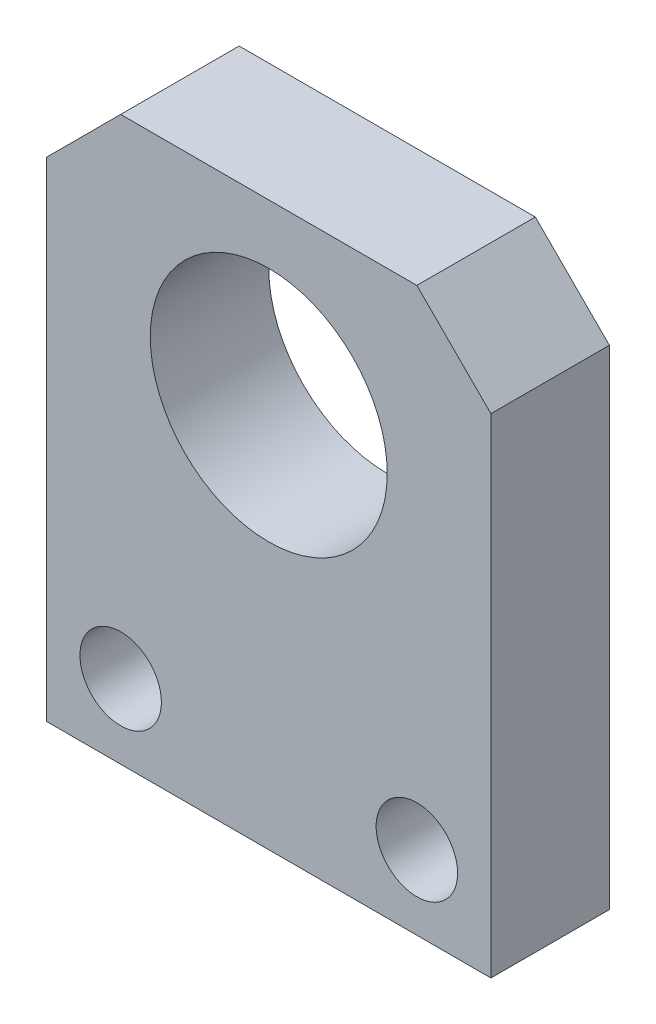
ISO-10303-21;
HEADER;
FILE_DESCRIPTION(('STEP AP214'),'2;1');
FILE_NAME('part.step','',(''),(''),'','','');
FILE_SCHEMA(('AUTOMOTIVE_DESIGN { 1 0 10303 214 1 1 1 1 }'));
ENDSEC;
DATA;
#1=APPLICATION_CONTEXT('core data for automotive mechanical design processes');
#2=APPLICATION_PROTOCOL_DEFINITION('international standard','automotive_design',2000,#1);
#3=PRODUCT_CONTEXT('',#1,'mechanical');
#4=PRODUCT('Part','Part','',(#3));
#5=PRODUCT_RELATED_PRODUCT_CATEGORY('part','',(#4));
#6=PRODUCT_DEFINITION_FORMATION('','',#4);
#7=PRODUCT_DEFINITION_CONTEXT('part definition',#1,'design');
#8=PRODUCT_DEFINITION('design','',#6,#7);
#9=PRODUCT_DEFINITION_SHAPE('','',#8);
#10=(LENGTH_UNIT() NAMED_UNIT(*) SI_UNIT(.MILLI.,.METRE.));
#11=(NAMED_UNIT(*) PLANE_ANGLE_UNIT() SI_UNIT($,.RADIAN.));
#12=(NAMED_UNIT(*) SI_UNIT($,.STERADIAN.) SOLID_ANGLE_UNIT());
#13=UNCERTAINTY_MEASURE_WITH_UNIT(LENGTH_MEASURE(1.E-05),#10,'distance_accuracy_value','');
#14=(GEOMETRIC_REPRESENTATION_CONTEXT(3) GLOBAL_UNCERTAINTY_ASSIGNED_CONTEXT((#13)) GLOBAL_UNIT_ASSIGNED_CONTEXT((#10,
#11,#12)) REPRESENTATION_CONTEXT('',''));
#15=CARTESIAN_POINT('',(0.,0.,0.));
#16=DIRECTION('',(0.,0.,1.));
#17=DIRECTION('',(1.,0.,0.));
#18=AXIS2_PLACEMENT_3D('',#15,#16,#17);
#19=CARTESIAN_POINT('',(0.,0.,0.));
#20=DIRECTION('',(0.,0.,-1.));
#21=DIRECTION('',(-1.,0.,0.));
#22=AXIS2_PLACEMENT_3D('',#19,#20,#21);
#23=PLANE('',#22);
#24=DIRECTION('',(0.,1.,0.));
#25=VECTOR('',#24,1.);
#26=CARTESIAN_POINT('',(-15.,-19.,0.));
#27=LINE('',#26,#25);
#28=CARTESIAN_POINT('',(-15.,-19.,0.));
#29=VERTEX_POINT('',#28);
#30=CARTESIAN_POINT('',(-15.,14.,0.));
#31=VERTEX_POINT('',#30);
#32=EDGE_CURVE('E67',#29,#31,#27,.T.);
#33=ORIENTED_EDGE('',*,*,#32,.T.);
#34=DIRECTION('',(0.707106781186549,0.707106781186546,0.));
#35=VECTOR('',#34,1.);
#36=CARTESIAN_POINT('',(-15.,14.,0.));
#37=LINE('',#36,#35);
#38=CARTESIAN_POINT('',(-9.99999999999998,19.,0.));
#39=VERTEX_POINT('',#38);
#40=EDGE_CURVE('E233',#31,#39,#37,.T.);
#41=ORIENTED_EDGE('',*,*,#40,.T.);
#42=DIRECTION('',(1.,0.,0.));
#43=VECTOR('',#42,1.);
#44=CARTESIAN_POINT('',(-15.,19.,0.));
#45=LINE('',#44,#43);
#46=CARTESIAN_POINT('',(10.,19.,0.));
#47=VERTEX_POINT('',#46);
#48=EDGE_CURVE('E239',#39,#47,#45,.T.);
#49=ORIENTED_EDGE('',*,*,#48,.T.);
#50=DIRECTION('',(0.707106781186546,-0.707106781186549,0.));
#51=VECTOR('',#50,1.);
#52=CARTESIAN_POINT('',(10.,19.,0.));
#53=LINE('',#52,#51);
#54=CARTESIAN_POINT('',(15.,14.,0.));
#55=VERTEX_POINT('',#54);
#56=EDGE_CURVE('E247',#47,#55,#53,.T.);
#57=ORIENTED_EDGE('',*,*,#56,.T.);
#58=DIRECTION('',(0.,1.,0.));
#59=VECTOR('',#58,1.);
#60=CARTESIAN_POINT('',(15.,-19.,0.));
#61=LINE('',#60,#59);
#62=CARTESIAN_POINT('',(15.,-19.,0.));
#63=VERTEX_POINT('',#62);
#64=EDGE_CURVE('E72',#55,#63,#61,.F.);
#65=ORIENTED_EDGE('',*,*,#64,.T.);
#66=DIRECTION('',(1.,0.,0.));
#67=VECTOR('',#66,1.);
#68=CARTESIAN_POINT('',(-15.,-19.,0.));
#69=LINE('',#68,#67);
#70=EDGE_CURVE('E70',#63,#29,#69,.F.);
#71=ORIENTED_EDGE('',*,*,#70,.T.);
#72=EDGE_LOOP('',(#33,#41,#49,#57,#65,#71));
#73=FACE_BOUND('',#72,.T.);
#74=CARTESIAN_POINT('',(0.,7.,0.));
#75=DIRECTION('',(0.,0.,1.));
#76=DIRECTION('',(1.,0.,0.));
#77=AXIS2_PLACEMENT_3D('',#74,#75,#76);
#78=CIRCLE('',#77,8.);
#79=CARTESIAN_POINT('',(8.,7.,0.));
#80=VERTEX_POINT('',#79);
#81=EDGE_CURVE('E78',#80,#80,#78,.T.);
#82=ORIENTED_EDGE('',*,*,#81,.T.);
#83=EDGE_LOOP('',(#82));
#84=FACE_BOUND('',#83,.T.);
#85=CARTESIAN_POINT('',(-10.,-14.,0.));
#86=DIRECTION('',(0.,0.,1.));
#87=DIRECTION('',(1.,0.,0.));
#88=AXIS2_PLACEMENT_3D('',#85,#86,#87);
#89=CIRCLE('',#88,2.75);
#90=CARTESIAN_POINT('',(-7.25,-14.,0.));
#91=VERTEX_POINT('',#90);
#92=EDGE_CURVE('E103',#91,#91,#89,.T.);
#93=ORIENTED_EDGE('',*,*,#92,.T.);
#94=EDGE_LOOP('',(#93));
#95=FACE_BOUND('',#94,.T.);
#96=CARTESIAN_POINT('',(10.,-14.,0.));
#97=DIRECTION('',(0.,0.,1.));
#98=DIRECTION('',(1.,0.,0.));
#99=AXIS2_PLACEMENT_3D('',#96,#97,#98);
#100=CIRCLE('',#99,2.75);
#101=CARTESIAN_POINT('',(12.75,-14.,0.));
#102=VERTEX_POINT('',#101);
#103=EDGE_CURVE('E20',#102,#102,#100,.T.);
#104=ORIENTED_EDGE('',*,*,#103,.T.);
#105=EDGE_LOOP('',(#104));
#106=FACE_BOUND('',#105,.T.);
#107=ADVANCED_FACE('F17',(#73,#84,#95,#106),#23,.T.);
#108=CARTESIAN_POINT('',(10.,-14.,0.));
#109=DIRECTION('',(0.,0.,1.));
#110=DIRECTION('',(1.,0.,0.));
#111=AXIS2_PLACEMENT_3D('',#108,#109,#110);
#112=CYLINDRICAL_SURFACE('',#111,2.75);
#113=ORIENTED_EDGE('',*,*,#103,.F.);
#114=EDGE_LOOP('',(#113));
#115=FACE_BOUND('',#114,.T.);
#116=CARTESIAN_POINT('',(10.,-14.,8.));
#117=DIRECTION('',(0.,0.,1.));
#118=DIRECTION('',(1.,0.,0.));
#119=AXIS2_PLACEMENT_3D('',#116,#117,#118);
#120=CIRCLE('',#119,2.75);
#121=CARTESIAN_POINT('',(12.75,-14.,8.));
#122=VERTEX_POINT('',#121);
#123=EDGE_CURVE('E99',#122,#122,#120,.T.);
#124=ORIENTED_EDGE('',*,*,#123,.T.);
#125=EDGE_LOOP('',(#124));
#126=FACE_BOUND('',#125,.T.);
#127=ADVANCED_FACE('F111',(#115,#126),#112,.F.);
#128=CARTESIAN_POINT('',(-10.,-14.,0.));
#129=DIRECTION('',(0.,0.,1.));
#130=DIRECTION('',(1.,0.,0.));
#131=AXIS2_PLACEMENT_3D('',#128,#129,#130);
#132=CYLINDRICAL_SURFACE('',#131,2.75);
#133=ORIENTED_EDGE('',*,*,#92,.F.);
#134=EDGE_LOOP('',(#133));
#135=FACE_BOUND('',#134,.T.);
#136=CARTESIAN_POINT('',(-10.,-14.,8.));
#137=DIRECTION('',(0.,0.,1.));
#138=DIRECTION('',(1.,0.,0.));
#139=AXIS2_PLACEMENT_3D('',#136,#137,#138);
#140=CIRCLE('',#139,2.75);
#141=CARTESIAN_POINT('',(-7.25,-14.,8.));
#142=VERTEX_POINT('',#141);
#143=EDGE_CURVE('E96',#142,#142,#140,.T.);
#144=ORIENTED_EDGE('',*,*,#143,.T.);
#145=EDGE_LOOP('',(#144));
#146=FACE_BOUND('',#145,.T.);
#147=ADVANCED_FACE('F114',(#135,#146),#132,.F.);
#148=CARTESIAN_POINT('',(0.,7.,0.));
#149=DIRECTION('',(0.,0.,1.));
#150=DIRECTION('',(1.,0.,0.));
#151=AXIS2_PLACEMENT_3D('',#148,#149,#150);
#152=CYLINDRICAL_SURFACE('',#151,8.);
#153=ORIENTED_EDGE('',*,*,#81,.F.);
#154=EDGE_LOOP('',(#153));
#155=FACE_BOUND('',#154,.T.);
#156=CARTESIAN_POINT('',(0.,7.,8.));
#157=DIRECTION('',(0.,0.,1.));
#158=DIRECTION('',(1.,0.,0.));
#159=AXIS2_PLACEMENT_3D('',#156,#157,#158);
#160=CIRCLE('',#159,8.);
#161=CARTESIAN_POINT('',(8.,7.,8.));
#162=VERTEX_POINT('',#161);
#163=EDGE_CURVE('E93',#162,#162,#160,.T.);
#164=ORIENTED_EDGE('',*,*,#163,.T.);
#165=EDGE_LOOP('',(#164));
#166=FACE_BOUND('',#165,.T.);
#167=ADVANCED_FACE('F146',(#155,#166),#152,.F.);
#168=CARTESIAN_POINT('',(-15.,-19.,8.));
#169=DIRECTION('',(0.,1.,0.));
#170=DIRECTION('',(0.,0.,1.));
#171=AXIS2_PLACEMENT_3D('',#168,#169,#170);
#172=PLANE('',#171);
#173=DIRECTION('',(0.,0.,1.));
#174=VECTOR('',#173,1.);
#175=CARTESIAN_POINT('',(15.,-19.,8.));
#176=LINE('',#175,#174);
#177=CARTESIAN_POINT('',(15.,-19.,8.));
#178=VERTEX_POINT('',#177);
#179=EDGE_CURVE('E249',#63,#178,#176,.T.);
#180=ORIENTED_EDGE('',*,*,#179,.T.);
#181=DIRECTION('',(-1.,0.,0.));
#182=VECTOR('',#181,1.);
#183=CARTESIAN_POINT('',(0.,-19.,8.));
#184=LINE('',#183,#182);
#185=CARTESIAN_POINT('',(-15.,-19.,8.));
#186=VERTEX_POINT('',#185);
#187=EDGE_CURVE('E89',#178,#186,#184,.T.);
#188=ORIENTED_EDGE('',*,*,#187,.T.);
#189=DIRECTION('',(0.,0.,-1.));
#190=VECTOR('',#189,1.);
#191=CARTESIAN_POINT('',(-15.,-19.,8.));
#192=LINE('',#191,#190);
#193=EDGE_CURVE('E77',#186,#29,#192,.T.);
#194=ORIENTED_EDGE('',*,*,#193,.T.);
#195=ORIENTED_EDGE('',*,*,#70,.F.);
#196=EDGE_LOOP('',(#180,#188,#194,#195));
#197=FACE_BOUND('',#196,.T.);
#198=ADVANCED_FACE('F88',(#197),#172,.F.);
#199=CARTESIAN_POINT('',(-15.,-19.,8.));
#200=DIRECTION('',(1.,0.,0.));
#201=DIRECTION('',(0.,0.,-1.));
#202=AXIS2_PLACEMENT_3D('',#199,#200,#201);
#203=PLANE('',#202);
#204=DIRECTION('',(0.,0.,1.));
#205=VECTOR('',#204,1.);
#206=CARTESIAN_POINT('',(-15.,14.,8.));
#207=LINE('',#206,#205);
#208=CARTESIAN_POINT('',(-15.,14.,8.));
#209=VERTEX_POINT('',#208);
#210=EDGE_CURVE('E85',#209,#31,#207,.F.);
#211=ORIENTED_EDGE('',*,*,#210,.T.);
#212=ORIENTED_EDGE('',*,*,#32,.F.);
#213=ORIENTED_EDGE('',*,*,#193,.F.);
#214=DIRECTION('',(0.,1.,0.));
#215=VECTOR('',#214,1.);
#216=CARTESIAN_POINT('',(-15.,0.,8.));
#217=LINE('',#216,#215);
#218=EDGE_CURVE('E254',#186,#209,#217,.T.);
#219=ORIENTED_EDGE('',*,*,#218,.T.);
#220=EDGE_LOOP('',(#211,#212,#213,#219));
#221=FACE_BOUND('',#220,.T.);
#222=ADVANCED_FACE('F82',(#221),#203,.F.);
#223=CARTESIAN_POINT('',(-15.,14.,8.));
#224=DIRECTION('',(0.707106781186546,-0.707106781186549,0.));
#225=DIRECTION('',(0.707106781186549,0.707106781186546,0.));
#226=AXIS2_PLACEMENT_3D('',#223,#224,#225);
#227=PLANE('',#226);
#228=DIRECTION('',(0.,0.,-1.));
#229=VECTOR('',#228,1.);
#230=CARTESIAN_POINT('',(-9.99999999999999,19.,8.));
#231=LINE('',#230,#229);
#232=CARTESIAN_POINT('',(-9.99999999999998,19.,8.));
#233=VERTEX_POINT('',#232);
#234=EDGE_CURVE('E232',#233,#39,#231,.T.);
#235=ORIENTED_EDGE('',*,*,#234,.T.);
#236=ORIENTED_EDGE('',*,*,#40,.F.);
#237=ORIENTED_EDGE('',*,*,#210,.F.);
#238=DIRECTION('',(0.707106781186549,0.707106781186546,0.));
#239=VECTOR('',#238,1.);
#240=CARTESIAN_POINT('',(-15.,14.,8.));
#241=LINE('',#240,#239);
#242=EDGE_CURVE('E235',#209,#233,#241,.T.);
#243=ORIENTED_EDGE('',*,*,#242,.T.);
#244=EDGE_LOOP('',(#235,#236,#237,#243));
#245=FACE_BOUND('',#244,.T.);
#246=ADVANCED_FACE('F137',(#245),#227,.F.);
#247=CARTESIAN_POINT('',(-15.,19.,8.));
#248=DIRECTION('',(0.,-1.,0.));
#249=DIRECTION('',(0.,0.,-1.));
#250=AXIS2_PLACEMENT_3D('',#247,#248,#249);
#251=PLANE('',#250);
#252=DIRECTION('',(0.,0.,1.));
#253=VECTOR('',#252,1.);
#254=CARTESIAN_POINT('',(10.,19.,8.));
#255=LINE('',#254,#253);
#256=CARTESIAN_POINT('',(10.,19.,8.));
#257=VERTEX_POINT('',#256);
#258=EDGE_CURVE('E241',#257,#47,#255,.F.);
#259=ORIENTED_EDGE('',*,*,#258,.T.);
#260=ORIENTED_EDGE('',*,*,#48,.F.);
#261=ORIENTED_EDGE('',*,*,#234,.F.);
#262=DIRECTION('',(-1.,0.,0.));
#263=VECTOR('',#262,1.);
#264=CARTESIAN_POINT('',(0.,19.,8.));
#265=LINE('',#264,#263);
#266=EDGE_CURVE('E257',#233,#257,#265,.F.);
#267=ORIENTED_EDGE('',*,*,#266,.T.);
#268=EDGE_LOOP('',(#259,#260,#261,#267));
#269=FACE_BOUND('',#268,.T.);
#270=ADVANCED_FACE('F133',(#269),#251,.F.);
#271=CARTESIAN_POINT('',(10.,19.,8.));
#272=DIRECTION('',(-0.707106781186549,-0.707106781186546,0.));
#273=DIRECTION('',(0.707106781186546,-0.707106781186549,0.));
#274=AXIS2_PLACEMENT_3D('',#271,#272,#273);
#275=PLANE('',#274);
#276=DIRECTION('',(0.,0.,1.));
#277=VECTOR('',#276,1.);
#278=CARTESIAN_POINT('',(15.,14.,8.));
#279=LINE('',#278,#277);
#280=CARTESIAN_POINT('',(15.,14.,8.));
#281=VERTEX_POINT('',#280);
#282=EDGE_CURVE('E34',#281,#55,#279,.F.);
#283=ORIENTED_EDGE('',*,*,#282,.T.);
#284=ORIENTED_EDGE('',*,*,#56,.F.);
#285=ORIENTED_EDGE('',*,*,#258,.F.);
#286=DIRECTION('',(0.707106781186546,-0.707106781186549,0.));
#287=VECTOR('',#286,1.);
#288=CARTESIAN_POINT('',(10.,19.,8.));
#289=LINE('',#288,#287);
#290=EDGE_CURVE('E26',#257,#281,#289,.T.);
#291=ORIENTED_EDGE('',*,*,#290,.T.);
#292=EDGE_LOOP('',(#283,#284,#285,#291));
#293=FACE_BOUND('',#292,.T.);
#294=ADVANCED_FACE('F126',(#293),#275,.F.);
#295=CARTESIAN_POINT('',(15.,-19.,8.));
#296=DIRECTION('',(-1.,0.,0.));
#297=DIRECTION('',(0.,0.,1.));
#298=AXIS2_PLACEMENT_3D('',#295,#296,#297);
#299=PLANE('',#298);
#300=ORIENTED_EDGE('',*,*,#282,.F.);
#301=DIRECTION('',(0.,1.,0.));
#302=VECTOR('',#301,1.);
#303=CARTESIAN_POINT('',(15.,0.,8.));
#304=LINE('',#303,#302);
#305=EDGE_CURVE('E11',#281,#178,#304,.F.);
#306=ORIENTED_EDGE('',*,*,#305,.T.);
#307=ORIENTED_EDGE('',*,*,#179,.F.);
#308=ORIENTED_EDGE('',*,*,#64,.F.);
#309=EDGE_LOOP('',(#300,#306,#307,#308));
#310=FACE_BOUND('',#309,.T.);
#311=ADVANCED_FACE('F119',(#310),#299,.F.);
#312=CARTESIAN_POINT('',(0.,0.,8.));
#313=DIRECTION('',(0.,0.,-1.));
#314=DIRECTION('',(-1.,0.,0.));
#315=AXIS2_PLACEMENT_3D('',#312,#313,#314);
#316=PLANE('',#315);
#317=ORIENTED_EDGE('',*,*,#290,.F.);
#318=ORIENTED_EDGE('',*,*,#266,.F.);
#319=ORIENTED_EDGE('',*,*,#242,.F.);
#320=ORIENTED_EDGE('',*,*,#218,.F.);
#321=ORIENTED_EDGE('',*,*,#187,.F.);
#322=ORIENTED_EDGE('',*,*,#305,.F.);
#323=EDGE_LOOP('',(#317,#318,#319,#320,#321,#322));
#324=FACE_BOUND('',#323,.T.);
#325=ORIENTED_EDGE('',*,*,#163,.F.);
#326=EDGE_LOOP('',(#325));
#327=FACE_BOUND('',#326,.T.);
#328=ORIENTED_EDGE('',*,*,#143,.F.);
#329=EDGE_LOOP('',(#328));
#330=FACE_BOUND('',#329,.T.);
#331=ORIENTED_EDGE('',*,*,#123,.F.);
#332=EDGE_LOOP('',(#331));
#333=FACE_BOUND('',#332,.T.);
#334=ADVANCED_FACE('F117',(#324,#327,#330,#333),#316,.F.);
#335=CLOSED_SHELL('',(#107,#127,#147,#167,#198,#222,#246,#270,#294,#311,#334));
#336=MANIFOLD_SOLID_BREP('B1',#335);
#337=ADVANCED_BREP_SHAPE_REPRESENTATION('',(#18,#336),#14);
#338=SHAPE_DEFINITION_REPRESENTATION(#9,#337);
ENDSEC;
END-ISO-10303-21;
